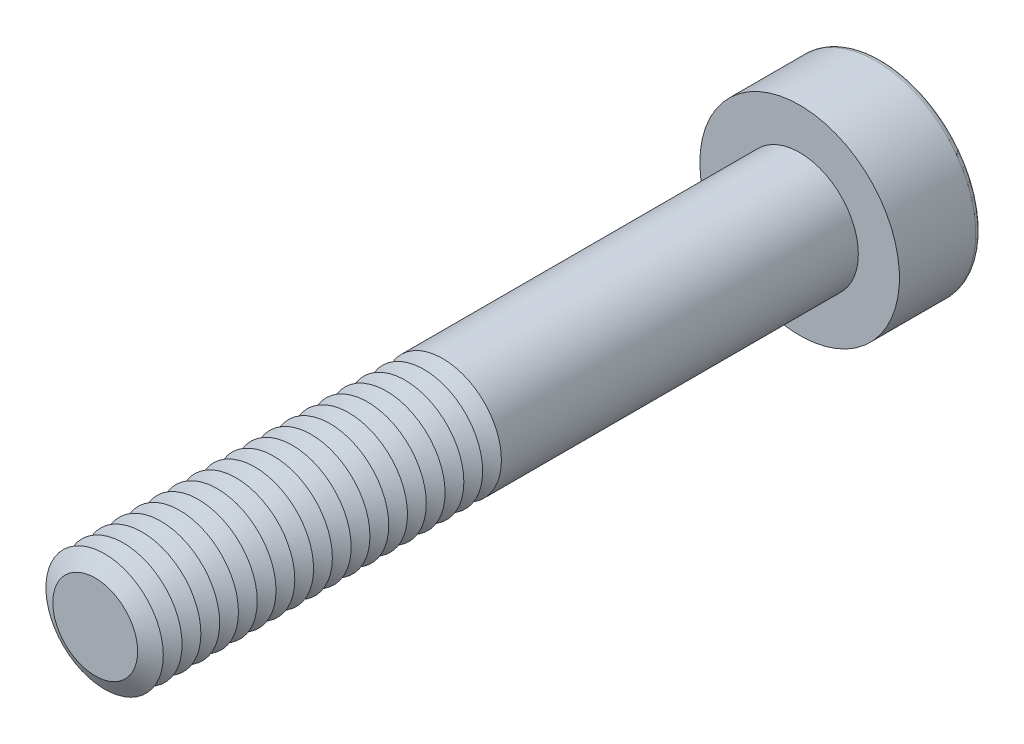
ISO-10303-21;
HEADER;
FILE_DESCRIPTION(('STEP AP214'),'2;1');
FILE_NAME('part.step','',(''),(''),'','','');
FILE_SCHEMA(('AUTOMOTIVE_DESIGN { 1 0 10303 214 1 1 1 1 }'));
ENDSEC;
DATA;
#1=APPLICATION_CONTEXT('core data for automotive mechanical design processes');
#2=APPLICATION_PROTOCOL_DEFINITION('international standard','automotive_design',2000,#1);
#3=PRODUCT_CONTEXT('',#1,'mechanical');
#4=PRODUCT('Part','Part','',(#3));
#5=PRODUCT_RELATED_PRODUCT_CATEGORY('part','',(#4));
#6=PRODUCT_DEFINITION_FORMATION('','',#4);
#7=PRODUCT_DEFINITION_CONTEXT('part definition',#1,'design');
#8=PRODUCT_DEFINITION('design','',#6,#7);
#9=PRODUCT_DEFINITION_SHAPE('','',#8);
#10=(LENGTH_UNIT() NAMED_UNIT(*) SI_UNIT(.MILLI.,.METRE.));
#11=(NAMED_UNIT(*) PLANE_ANGLE_UNIT() SI_UNIT($,.RADIAN.));
#12=(NAMED_UNIT(*) SI_UNIT($,.STERADIAN.) SOLID_ANGLE_UNIT());
#13=UNCERTAINTY_MEASURE_WITH_UNIT(LENGTH_MEASURE(1.E-05),#10,'distance_accuracy_value','');
#14=(GEOMETRIC_REPRESENTATION_CONTEXT(3) GLOBAL_UNCERTAINTY_ASSIGNED_CONTEXT((#13)) GLOBAL_UNIT_ASSIGNED_CONTEXT((#10,
#11,#12)) REPRESENTATION_CONTEXT('',''));
#15=CARTESIAN_POINT('',(0.,0.,0.));
#16=DIRECTION('',(0.,0.,1.));
#17=DIRECTION('',(1.,0.,0.));
#18=AXIS2_PLACEMENT_3D('',#15,#16,#17);
#19=CARTESIAN_POINT('',(0.,0.,27.2));
#20=DIRECTION('',(0.,0.,1.));
#21=DIRECTION('',(1.,0.,0.));
#22=AXIS2_PLACEMENT_3D('',#19,#20,#21);
#23=CONICAL_SURFACE('',#22,2.5,1.0471975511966);
#24=CARTESIAN_POINT('',(0.,0.,26.8));
#25=DIRECTION('',(0.,0.,1.));
#26=DIRECTION('',(1.,0.,0.));
#27=AXIS2_PLACEMENT_3D('',#24,#25,#26);
#28=CIRCLE('',#27,1.80717967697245);
#29=CARTESIAN_POINT('',(1.80717967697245,0.,26.8));
#30=VERTEX_POINT('',#29);
#31=EDGE_CURVE('E314',#30,#30,#28,.T.);
#32=ORIENTED_EDGE('',*,*,#31,.T.);
#33=EDGE_LOOP('',(#32));
#34=FACE_BOUND('',#33,.T.);
#35=CARTESIAN_POINT('',(0.,0.,27.2));
#36=DIRECTION('',(0.,0.,1.));
#37=DIRECTION('',(1.,0.,0.));
#38=AXIS2_PLACEMENT_3D('',#35,#36,#37);
#39=CIRCLE('',#38,2.5);
#40=CARTESIAN_POINT('',(2.5,0.,27.2));
#41=VERTEX_POINT('',#40);
#42=EDGE_CURVE('E317',#41,#41,#39,.T.);
#43=ORIENTED_EDGE('',*,*,#42,.F.);
#44=EDGE_LOOP('',(#43));
#45=FACE_BOUND('',#44,.T.);
#46=ADVANCED_FACE('F39',(#34,#45),#23,.T.);
#47=CARTESIAN_POINT('',(0.,0.,26.8));
#48=DIRECTION('',(0.,0.,-1.));
#49=DIRECTION('',(-1.,0.,0.));
#50=AXIS2_PLACEMENT_3D('',#47,#48,#49);
#51=CONICAL_SURFACE('',#50,1.80717967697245,1.04719755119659);
#52=CARTESIAN_POINT('',(0.,0.,26.4));
#53=DIRECTION('',(0.,0.,1.));
#54=DIRECTION('',(1.,0.,0.));
#55=AXIS2_PLACEMENT_3D('',#52,#53,#54);
#56=CIRCLE('',#55,2.5);
#57=CARTESIAN_POINT('',(2.5,0.,26.4));
#58=VERTEX_POINT('',#57);
#59=EDGE_CURVE('E325',#58,#58,#56,.T.);
#60=ORIENTED_EDGE('',*,*,#59,.T.);
#61=EDGE_LOOP('',(#60));
#62=FACE_BOUND('',#61,.T.);
#63=ORIENTED_EDGE('',*,*,#31,.F.);
#64=EDGE_LOOP('',(#63));
#65=FACE_BOUND('',#64,.T.);
#66=ADVANCED_FACE('F245',(#62,#65),#51,.T.);
#67=CARTESIAN_POINT('',(0.,0.,30.));
#68=DIRECTION('',(0.,0.,1.));
#69=DIRECTION('',(1.,0.,0.));
#70=AXIS2_PLACEMENT_3D('',#67,#68,#69);
#71=PLANE('',#70);
#72=CARTESIAN_POINT('',(0.,0.,30.));
#73=DIRECTION('',(0.,0.,1.));
#74=DIRECTION('',(1.,0.,0.));
#75=AXIS2_PLACEMENT_3D('',#72,#73,#74);
#76=CIRCLE('',#75,1.80717967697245);
#77=CARTESIAN_POINT('',(1.80717967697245,0.,30.));
#78=VERTEX_POINT('',#77);
#79=EDGE_CURVE('E174',#78,#78,#76,.T.);
#80=ORIENTED_EDGE('',*,*,#79,.T.);
#81=EDGE_LOOP('',(#80));
#82=FACE_BOUND('',#81,.T.);
#83=ADVANCED_FACE('F251',(#82),#71,.T.);
#84=CARTESIAN_POINT('',(0.,0.,30.));
#85=DIRECTION('',(0.,0.,-1.));
#86=DIRECTION('',(-1.,0.,0.));
#87=AXIS2_PLACEMENT_3D('',#84,#85,#86);
#88=CONICAL_SURFACE('',#87,1.80717967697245,1.04719755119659);
#89=CARTESIAN_POINT('',(0.,0.,29.6));
#90=DIRECTION('',(0.,0.,1.));
#91=DIRECTION('',(1.,0.,0.));
#92=AXIS2_PLACEMENT_3D('',#89,#90,#91);
#93=CIRCLE('',#92,2.5);
#94=CARTESIAN_POINT('',(2.5,0.,29.6));
#95=VERTEX_POINT('',#94);
#96=EDGE_CURVE('E291',#95,#95,#93,.T.);
#97=ORIENTED_EDGE('',*,*,#96,.T.);
#98=EDGE_LOOP('',(#97));
#99=FACE_BOUND('',#98,.T.);
#100=ORIENTED_EDGE('',*,*,#79,.F.);
#101=EDGE_LOOP('',(#100));
#102=FACE_BOUND('',#101,.T.);
#103=ADVANCED_FACE('F199',(#99,#102),#88,.T.);
#104=CARTESIAN_POINT('',(0.,0.,29.6));
#105=DIRECTION('',(0.,0.,1.));
#106=DIRECTION('',(1.,0.,0.));
#107=AXIS2_PLACEMENT_3D('',#104,#105,#106);
#108=CONICAL_SURFACE('',#107,2.5,1.0471975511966);
#109=CARTESIAN_POINT('',(0.,0.,29.2));
#110=DIRECTION('',(0.,0.,1.));
#111=DIRECTION('',(1.,0.,0.));
#112=AXIS2_PLACEMENT_3D('',#109,#110,#111);
#113=CIRCLE('',#112,1.80717967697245);
#114=CARTESIAN_POINT('',(1.80717967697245,0.,29.2));
#115=VERTEX_POINT('',#114);
#116=EDGE_CURVE('E288',#115,#115,#113,.T.);
#117=ORIENTED_EDGE('',*,*,#116,.T.);
#118=EDGE_LOOP('',(#117));
#119=FACE_BOUND('',#118,.T.);
#120=ORIENTED_EDGE('',*,*,#96,.F.);
#121=EDGE_LOOP('',(#120));
#122=FACE_BOUND('',#121,.T.);
#123=ADVANCED_FACE('F277',(#119,#122),#108,.T.);
#124=CARTESIAN_POINT('',(0.,0.,29.2));
#125=DIRECTION('',(0.,0.,-1.));
#126=DIRECTION('',(-1.,0.,0.));
#127=AXIS2_PLACEMENT_3D('',#124,#125,#126);
#128=CONICAL_SURFACE('',#127,1.80717967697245,1.04719755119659);
#129=CARTESIAN_POINT('',(0.,0.,28.8));
#130=DIRECTION('',(0.,0.,1.));
#131=DIRECTION('',(1.,0.,0.));
#132=AXIS2_PLACEMENT_3D('',#129,#130,#131);
#133=CIRCLE('',#132,2.5);
#134=CARTESIAN_POINT('',(2.5,0.,28.8));
#135=VERTEX_POINT('',#134);
#136=EDGE_CURVE('E300',#135,#135,#133,.T.);
#137=ORIENTED_EDGE('',*,*,#136,.T.);
#138=EDGE_LOOP('',(#137));
#139=FACE_BOUND('',#138,.T.);
#140=ORIENTED_EDGE('',*,*,#116,.F.);
#141=EDGE_LOOP('',(#140));
#142=FACE_BOUND('',#141,.T.);
#143=ADVANCED_FACE('F274',(#139,#142),#128,.T.);
#144=CARTESIAN_POINT('',(0.,0.,28.8));
#145=DIRECTION('',(0.,0.,1.));
#146=DIRECTION('',(1.,0.,0.));
#147=AXIS2_PLACEMENT_3D('',#144,#145,#146);
#148=CONICAL_SURFACE('',#147,2.5,1.0471975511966);
#149=CARTESIAN_POINT('',(0.,0.,28.4));
#150=DIRECTION('',(0.,0.,1.));
#151=DIRECTION('',(1.,0.,0.));
#152=AXIS2_PLACEMENT_3D('',#149,#150,#151);
#153=CIRCLE('',#152,1.80717967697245);
#154=CARTESIAN_POINT('',(1.80717967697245,0.,28.4));
#155=VERTEX_POINT('',#154);
#156=EDGE_CURVE('E293',#155,#155,#153,.T.);
#157=ORIENTED_EDGE('',*,*,#156,.T.);
#158=EDGE_LOOP('',(#157));
#159=FACE_BOUND('',#158,.T.);
#160=ORIENTED_EDGE('',*,*,#136,.F.);
#161=EDGE_LOOP('',(#160));
#162=FACE_BOUND('',#161,.T.);
#163=ADVANCED_FACE('F270',(#159,#162),#148,.T.);
#164=CARTESIAN_POINT('',(0.,0.,28.4));
#165=DIRECTION('',(0.,0.,-1.));
#166=DIRECTION('',(-1.,0.,0.));
#167=AXIS2_PLACEMENT_3D('',#164,#165,#166);
#168=CONICAL_SURFACE('',#167,1.80717967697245,1.04719755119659);
#169=CARTESIAN_POINT('',(0.,0.,28.));
#170=DIRECTION('',(0.,0.,1.));
#171=DIRECTION('',(1.,0.,0.));
#172=AXIS2_PLACEMENT_3D('',#169,#170,#171);
#173=CIRCLE('',#172,2.5);
#174=CARTESIAN_POINT('',(2.5,0.,28.));
#175=VERTEX_POINT('',#174);
#176=EDGE_CURVE('E310',#175,#175,#173,.T.);
#177=ORIENTED_EDGE('',*,*,#176,.T.);
#178=EDGE_LOOP('',(#177));
#179=FACE_BOUND('',#178,.T.);
#180=ORIENTED_EDGE('',*,*,#156,.F.);
#181=EDGE_LOOP('',(#180));
#182=FACE_BOUND('',#181,.T.);
#183=ADVANCED_FACE('F266',(#179,#182),#168,.T.);
#184=CARTESIAN_POINT('',(0.,0.,28.));
#185=DIRECTION('',(0.,0.,1.));
#186=DIRECTION('',(1.,0.,0.));
#187=AXIS2_PLACEMENT_3D('',#184,#185,#186);
#188=CONICAL_SURFACE('',#187,2.5,1.0471975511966);
#189=CARTESIAN_POINT('',(0.,0.,27.6));
#190=DIRECTION('',(0.,0.,1.));
#191=DIRECTION('',(1.,0.,0.));
#192=AXIS2_PLACEMENT_3D('',#189,#190,#191);
#193=CIRCLE('',#192,1.80717967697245);
#194=CARTESIAN_POINT('',(1.80717967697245,0.,27.6));
#195=VERTEX_POINT('',#194);
#196=EDGE_CURVE('E306',#195,#195,#193,.T.);
#197=ORIENTED_EDGE('',*,*,#196,.T.);
#198=EDGE_LOOP('',(#197));
#199=FACE_BOUND('',#198,.T.);
#200=ORIENTED_EDGE('',*,*,#176,.F.);
#201=EDGE_LOOP('',(#200));
#202=FACE_BOUND('',#201,.T.);
#203=ADVANCED_FACE('F262',(#199,#202),#188,.T.);
#204=CARTESIAN_POINT('',(0.,0.,27.6));
#205=DIRECTION('',(0.,0.,-1.));
#206=DIRECTION('',(-1.,0.,0.));
#207=AXIS2_PLACEMENT_3D('',#204,#205,#206);
#208=CONICAL_SURFACE('',#207,1.80717967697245,1.04719755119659);
#209=ORIENTED_EDGE('',*,*,#42,.T.);
#210=EDGE_LOOP('',(#209));
#211=FACE_BOUND('',#210,.T.);
#212=ORIENTED_EDGE('',*,*,#196,.F.);
#213=EDGE_LOOP('',(#212));
#214=FACE_BOUND('',#213,.T.);
#215=ADVANCED_FACE('F258',(#211,#214),#208,.T.);
#216=CARTESIAN_POINT('',(0.,0.,26.4));
#217=DIRECTION('',(0.,0.,1.));
#218=DIRECTION('',(1.,0.,0.));
#219=AXIS2_PLACEMENT_3D('',#216,#217,#218);
#220=CONICAL_SURFACE('',#219,2.5,1.0471975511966);
#221=CARTESIAN_POINT('',(0.,0.,26.));
#222=DIRECTION('',(0.,0.,1.));
#223=DIRECTION('',(1.,0.,0.));
#224=AXIS2_PLACEMENT_3D('',#221,#222,#223);
#225=CIRCLE('',#224,1.80717967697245);
#226=CARTESIAN_POINT('',(1.80717967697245,0.,26.));
#227=VERTEX_POINT('',#226);
#228=EDGE_CURVE('E321',#227,#227,#225,.T.);
#229=ORIENTED_EDGE('',*,*,#228,.T.);
#230=EDGE_LOOP('',(#229));
#231=FACE_BOUND('',#230,.T.);
#232=ORIENTED_EDGE('',*,*,#59,.F.);
#233=EDGE_LOOP('',(#232));
#234=FACE_BOUND('',#233,.T.);
#235=ADVANCED_FACE('F261',(#231,#234),#220,.T.);
#236=CARTESIAN_POINT('',(0.,0.,26.));
#237=DIRECTION('',(0.,0.,-1.));
#238=DIRECTION('',(-1.,0.,0.));
#239=AXIS2_PLACEMENT_3D('',#236,#237,#238);
#240=CONICAL_SURFACE('',#239,1.80717967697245,1.04719755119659);
#241=CARTESIAN_POINT('',(0.,0.,25.6));
#242=DIRECTION('',(0.,0.,1.));
#243=DIRECTION('',(1.,0.,0.));
#244=AXIS2_PLACEMENT_3D('',#241,#242,#243);
#245=CIRCLE('',#244,2.5);
#246=CARTESIAN_POINT('',(2.5,0.,25.6));
#247=VERTEX_POINT('',#246);
#248=EDGE_CURVE('E333',#247,#247,#245,.T.);
#249=ORIENTED_EDGE('',*,*,#248,.T.);
#250=EDGE_LOOP('',(#249));
#251=FACE_BOUND('',#250,.T.);
#252=ORIENTED_EDGE('',*,*,#228,.F.);
#253=EDGE_LOOP('',(#252));
#254=FACE_BOUND('',#253,.T.);
#255=ADVANCED_FACE('F543',(#251,#254),#240,.T.);
#256=CARTESIAN_POINT('',(0.,0.,25.6));
#257=DIRECTION('',(0.,0.,1.));
#258=DIRECTION('',(1.,0.,0.));
#259=AXIS2_PLACEMENT_3D('',#256,#257,#258);
#260=CONICAL_SURFACE('',#259,2.5,1.0471975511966);
#261=CARTESIAN_POINT('',(0.,0.,25.2));
#262=DIRECTION('',(0.,0.,1.));
#263=DIRECTION('',(1.,0.,0.));
#264=AXIS2_PLACEMENT_3D('',#261,#262,#263);
#265=CIRCLE('',#264,1.80717967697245);
#266=CARTESIAN_POINT('',(1.80717967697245,0.,25.2));
#267=VERTEX_POINT('',#266);
#268=EDGE_CURVE('E329',#267,#267,#265,.T.);
#269=ORIENTED_EDGE('',*,*,#268,.T.);
#270=EDGE_LOOP('',(#269));
#271=FACE_BOUND('',#270,.T.);
#272=ORIENTED_EDGE('',*,*,#248,.F.);
#273=EDGE_LOOP('',(#272));
#274=FACE_BOUND('',#273,.T.);
#275=ADVANCED_FACE('F539',(#271,#274),#260,.T.);
#276=CARTESIAN_POINT('',(0.,0.,25.2));
#277=DIRECTION('',(0.,0.,-1.));
#278=DIRECTION('',(-1.,0.,0.));
#279=AXIS2_PLACEMENT_3D('',#276,#277,#278);
#280=CONICAL_SURFACE('',#279,1.80717967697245,1.04719755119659);
#281=CARTESIAN_POINT('',(0.,0.,24.8));
#282=DIRECTION('',(0.,0.,1.));
#283=DIRECTION('',(1.,0.,0.));
#284=AXIS2_PLACEMENT_3D('',#281,#282,#283);
#285=CIRCLE('',#284,2.5);
#286=CARTESIAN_POINT('',(2.5,0.,24.8));
#287=VERTEX_POINT('',#286);
#288=EDGE_CURVE('E341',#287,#287,#285,.T.);
#289=ORIENTED_EDGE('',*,*,#288,.T.);
#290=EDGE_LOOP('',(#289));
#291=FACE_BOUND('',#290,.T.);
#292=ORIENTED_EDGE('',*,*,#268,.F.);
#293=EDGE_LOOP('',(#292));
#294=FACE_BOUND('',#293,.T.);
#295=ADVANCED_FACE('F535',(#291,#294),#280,.T.);
#296=CARTESIAN_POINT('',(0.,0.,24.8));
#297=DIRECTION('',(0.,0.,1.));
#298=DIRECTION('',(1.,0.,0.));
#299=AXIS2_PLACEMENT_3D('',#296,#297,#298);
#300=CONICAL_SURFACE('',#299,2.5,1.0471975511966);
#301=CARTESIAN_POINT('',(0.,0.,24.4));
#302=DIRECTION('',(0.,0.,1.));
#303=DIRECTION('',(1.,0.,0.));
#304=AXIS2_PLACEMENT_3D('',#301,#302,#303);
#305=CIRCLE('',#304,1.80717967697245);
#306=CARTESIAN_POINT('',(1.80717967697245,0.,24.4));
#307=VERTEX_POINT('',#306);
#308=EDGE_CURVE('E337',#307,#307,#305,.T.);
#309=ORIENTED_EDGE('',*,*,#308,.T.);
#310=EDGE_LOOP('',(#309));
#311=FACE_BOUND('',#310,.T.);
#312=ORIENTED_EDGE('',*,*,#288,.F.);
#313=EDGE_LOOP('',(#312));
#314=FACE_BOUND('',#313,.T.);
#315=ADVANCED_FACE('F531',(#311,#314),#300,.T.);
#316=CARTESIAN_POINT('',(0.,0.,24.4));
#317=DIRECTION('',(0.,0.,-1.));
#318=DIRECTION('',(-1.,0.,0.));
#319=AXIS2_PLACEMENT_3D('',#316,#317,#318);
#320=CONICAL_SURFACE('',#319,1.80717967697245,1.04719755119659);
#321=CARTESIAN_POINT('',(0.,0.,24.));
#322=DIRECTION('',(0.,0.,1.));
#323=DIRECTION('',(1.,0.,0.));
#324=AXIS2_PLACEMENT_3D('',#321,#322,#323);
#325=CIRCLE('',#324,2.5);
#326=CARTESIAN_POINT('',(2.5,0.,24.));
#327=VERTEX_POINT('',#326);
#328=EDGE_CURVE('E348',#327,#327,#325,.T.);
#329=ORIENTED_EDGE('',*,*,#328,.T.);
#330=EDGE_LOOP('',(#329));
#331=FACE_BOUND('',#330,.T.);
#332=ORIENTED_EDGE('',*,*,#308,.F.);
#333=EDGE_LOOP('',(#332));
#334=FACE_BOUND('',#333,.T.);
#335=ADVANCED_FACE('F527',(#331,#334),#320,.T.);
#336=CARTESIAN_POINT('',(0.,0.,24.));
#337=DIRECTION('',(0.,0.,1.));
#338=DIRECTION('',(1.,0.,0.));
#339=AXIS2_PLACEMENT_3D('',#336,#337,#338);
#340=CONICAL_SURFACE('',#339,2.5,1.0471975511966);
#341=CARTESIAN_POINT('',(0.,0.,23.6));
#342=DIRECTION('',(0.,0.,1.));
#343=DIRECTION('',(1.,0.,0.));
#344=AXIS2_PLACEMENT_3D('',#341,#342,#343);
#345=CIRCLE('',#344,1.80717967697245);
#346=CARTESIAN_POINT('',(1.80717967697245,0.,23.6));
#347=VERTEX_POINT('',#346);
#348=EDGE_CURVE('E344',#347,#347,#345,.T.);
#349=ORIENTED_EDGE('',*,*,#348,.T.);
#350=EDGE_LOOP('',(#349));
#351=FACE_BOUND('',#350,.T.);
#352=ORIENTED_EDGE('',*,*,#328,.F.);
#353=EDGE_LOOP('',(#352));
#354=FACE_BOUND('',#353,.T.);
#355=ADVANCED_FACE('F523',(#351,#354),#340,.T.);
#356=CARTESIAN_POINT('',(0.,0.,23.6));
#357=DIRECTION('',(0.,0.,-1.));
#358=DIRECTION('',(-1.,0.,0.));
#359=AXIS2_PLACEMENT_3D('',#356,#357,#358);
#360=CONICAL_SURFACE('',#359,1.80717967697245,1.04719755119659);
#361=CARTESIAN_POINT('',(0.,0.,23.2));
#362=DIRECTION('',(0.,0.,1.));
#363=DIRECTION('',(1.,0.,0.));
#364=AXIS2_PLACEMENT_3D('',#361,#362,#363);
#365=CIRCLE('',#364,2.5);
#366=CARTESIAN_POINT('',(2.5,0.,23.2));
#367=VERTEX_POINT('',#366);
#368=EDGE_CURVE('E355',#367,#367,#365,.T.);
#369=ORIENTED_EDGE('',*,*,#368,.T.);
#370=EDGE_LOOP('',(#369));
#371=FACE_BOUND('',#370,.T.);
#372=ORIENTED_EDGE('',*,*,#348,.F.);
#373=EDGE_LOOP('',(#372));
#374=FACE_BOUND('',#373,.T.);
#375=ADVANCED_FACE('F519',(#371,#374),#360,.T.);
#376=CARTESIAN_POINT('',(0.,0.,23.2));
#377=DIRECTION('',(0.,0.,1.));
#378=DIRECTION('',(1.,0.,0.));
#379=AXIS2_PLACEMENT_3D('',#376,#377,#378);
#380=CONICAL_SURFACE('',#379,2.5,1.0471975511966);
#381=CARTESIAN_POINT('',(0.,0.,22.8));
#382=DIRECTION('',(0.,0.,1.));
#383=DIRECTION('',(1.,0.,0.));
#384=AXIS2_PLACEMENT_3D('',#381,#382,#383);
#385=CIRCLE('',#384,1.80717967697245);
#386=CARTESIAN_POINT('',(1.80717967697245,0.,22.8));
#387=VERTEX_POINT('',#386);
#388=EDGE_CURVE('E352',#387,#387,#385,.T.);
#389=ORIENTED_EDGE('',*,*,#388,.T.);
#390=EDGE_LOOP('',(#389));
#391=FACE_BOUND('',#390,.T.);
#392=ORIENTED_EDGE('',*,*,#368,.F.);
#393=EDGE_LOOP('',(#392));
#394=FACE_BOUND('',#393,.T.);
#395=ADVANCED_FACE('F515',(#391,#394),#380,.T.);
#396=CARTESIAN_POINT('',(0.,0.,22.8));
#397=DIRECTION('',(0.,0.,-1.));
#398=DIRECTION('',(-1.,0.,0.));
#399=AXIS2_PLACEMENT_3D('',#396,#397,#398);
#400=CONICAL_SURFACE('',#399,1.80717967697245,1.04719755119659);
#401=CARTESIAN_POINT('',(0.,0.,22.4));
#402=DIRECTION('',(0.,0.,1.));
#403=DIRECTION('',(1.,0.,0.));
#404=AXIS2_PLACEMENT_3D('',#401,#402,#403);
#405=CIRCLE('',#404,2.5);
#406=CARTESIAN_POINT('',(2.5,0.,22.4));
#407=VERTEX_POINT('',#406);
#408=EDGE_CURVE('E363',#407,#407,#405,.T.);
#409=ORIENTED_EDGE('',*,*,#408,.T.);
#410=EDGE_LOOP('',(#409));
#411=FACE_BOUND('',#410,.T.);
#412=ORIENTED_EDGE('',*,*,#388,.F.);
#413=EDGE_LOOP('',(#412));
#414=FACE_BOUND('',#413,.T.);
#415=ADVANCED_FACE('F511',(#411,#414),#400,.T.);
#416=CARTESIAN_POINT('',(0.,0.,22.4));
#417=DIRECTION('',(0.,0.,1.));
#418=DIRECTION('',(1.,0.,0.));
#419=AXIS2_PLACEMENT_3D('',#416,#417,#418);
#420=CONICAL_SURFACE('',#419,2.5,1.0471975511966);
#421=CARTESIAN_POINT('',(0.,0.,22.));
#422=DIRECTION('',(0.,0.,1.));
#423=DIRECTION('',(1.,0.,0.));
#424=AXIS2_PLACEMENT_3D('',#421,#422,#423);
#425=CIRCLE('',#424,1.80717967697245);
#426=CARTESIAN_POINT('',(1.80717967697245,0.,22.));
#427=VERTEX_POINT('',#426);
#428=EDGE_CURVE('E359',#427,#427,#425,.T.);
#429=ORIENTED_EDGE('',*,*,#428,.T.);
#430=EDGE_LOOP('',(#429));
#431=FACE_BOUND('',#430,.T.);
#432=ORIENTED_EDGE('',*,*,#408,.F.);
#433=EDGE_LOOP('',(#432));
#434=FACE_BOUND('',#433,.T.);
#435=ADVANCED_FACE('F507',(#431,#434),#420,.T.);
#436=CARTESIAN_POINT('',(0.,0.,22.));
#437=DIRECTION('',(0.,0.,-1.));
#438=DIRECTION('',(-1.,0.,0.));
#439=AXIS2_PLACEMENT_3D('',#436,#437,#438);
#440=CONICAL_SURFACE('',#439,1.80717967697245,1.04719755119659);
#441=CARTESIAN_POINT('',(0.,0.,21.6));
#442=DIRECTION('',(0.,0.,1.));
#443=DIRECTION('',(1.,0.,0.));
#444=AXIS2_PLACEMENT_3D('',#441,#442,#443);
#445=CIRCLE('',#444,2.5);
#446=CARTESIAN_POINT('',(2.5,0.,21.6));
#447=VERTEX_POINT('',#446);
#448=EDGE_CURVE('E371',#447,#447,#445,.T.);
#449=ORIENTED_EDGE('',*,*,#448,.T.);
#450=EDGE_LOOP('',(#449));
#451=FACE_BOUND('',#450,.T.);
#452=ORIENTED_EDGE('',*,*,#428,.F.);
#453=EDGE_LOOP('',(#452));
#454=FACE_BOUND('',#453,.T.);
#455=ADVANCED_FACE('F503',(#451,#454),#440,.T.);
#456=CARTESIAN_POINT('',(0.,0.,21.6));
#457=DIRECTION('',(0.,0.,1.));
#458=DIRECTION('',(1.,0.,0.));
#459=AXIS2_PLACEMENT_3D('',#456,#457,#458);
#460=CONICAL_SURFACE('',#459,2.5,1.0471975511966);
#461=CARTESIAN_POINT('',(0.,0.,21.2));
#462=DIRECTION('',(0.,0.,1.));
#463=DIRECTION('',(1.,0.,0.));
#464=AXIS2_PLACEMENT_3D('',#461,#462,#463);
#465=CIRCLE('',#464,1.80717967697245);
#466=CARTESIAN_POINT('',(1.80717967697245,0.,21.2));
#467=VERTEX_POINT('',#466);
#468=EDGE_CURVE('E367',#467,#467,#465,.T.);
#469=ORIENTED_EDGE('',*,*,#468,.T.);
#470=EDGE_LOOP('',(#469));
#471=FACE_BOUND('',#470,.T.);
#472=ORIENTED_EDGE('',*,*,#448,.F.);
#473=EDGE_LOOP('',(#472));
#474=FACE_BOUND('',#473,.T.);
#475=ADVANCED_FACE('F499',(#471,#474),#460,.T.);
#476=CARTESIAN_POINT('',(0.,0.,21.2));
#477=DIRECTION('',(0.,0.,-1.));
#478=DIRECTION('',(-1.,0.,0.));
#479=AXIS2_PLACEMENT_3D('',#476,#477,#478);
#480=CONICAL_SURFACE('',#479,1.80717967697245,1.04719755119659);
#481=CARTESIAN_POINT('',(0.,0.,20.8));
#482=DIRECTION('',(0.,0.,1.));
#483=DIRECTION('',(1.,0.,0.));
#484=AXIS2_PLACEMENT_3D('',#481,#482,#483);
#485=CIRCLE('',#484,2.5);
#486=CARTESIAN_POINT('',(2.5,0.,20.8));
#487=VERTEX_POINT('',#486);
#488=EDGE_CURVE('E379',#487,#487,#485,.T.);
#489=ORIENTED_EDGE('',*,*,#488,.T.);
#490=EDGE_LOOP('',(#489));
#491=FACE_BOUND('',#490,.T.);
#492=ORIENTED_EDGE('',*,*,#468,.F.);
#493=EDGE_LOOP('',(#492));
#494=FACE_BOUND('',#493,.T.);
#495=ADVANCED_FACE('F495',(#491,#494),#480,.T.);
#496=CARTESIAN_POINT('',(0.,0.,20.8));
#497=DIRECTION('',(0.,0.,1.));
#498=DIRECTION('',(1.,0.,0.));
#499=AXIS2_PLACEMENT_3D('',#496,#497,#498);
#500=CONICAL_SURFACE('',#499,2.5,1.0471975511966);
#501=CARTESIAN_POINT('',(0.,0.,20.4));
#502=DIRECTION('',(0.,0.,1.));
#503=DIRECTION('',(1.,0.,0.));
#504=AXIS2_PLACEMENT_3D('',#501,#502,#503);
#505=CIRCLE('',#504,1.80717967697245);
#506=CARTESIAN_POINT('',(1.80717967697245,0.,20.4));
#507=VERTEX_POINT('',#506);
#508=EDGE_CURVE('E375',#507,#507,#505,.T.);
#509=ORIENTED_EDGE('',*,*,#508,.T.);
#510=EDGE_LOOP('',(#509));
#511=FACE_BOUND('',#510,.T.);
#512=ORIENTED_EDGE('',*,*,#488,.F.);
#513=EDGE_LOOP('',(#512));
#514=FACE_BOUND('',#513,.T.);
#515=ADVANCED_FACE('F491',(#511,#514),#500,.T.);
#516=CARTESIAN_POINT('',(0.,0.,20.4));
#517=DIRECTION('',(0.,0.,-1.));
#518=DIRECTION('',(-1.,0.,0.));
#519=AXIS2_PLACEMENT_3D('',#516,#517,#518);
#520=CONICAL_SURFACE('',#519,1.80717967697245,1.04719755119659);
#521=CARTESIAN_POINT('',(0.,0.,20.));
#522=DIRECTION('',(0.,0.,1.));
#523=DIRECTION('',(1.,0.,0.));
#524=AXIS2_PLACEMENT_3D('',#521,#522,#523);
#525=CIRCLE('',#524,2.5);
#526=CARTESIAN_POINT('',(2.5,0.,20.));
#527=VERTEX_POINT('',#526);
#528=EDGE_CURVE('E387',#527,#527,#525,.T.);
#529=ORIENTED_EDGE('',*,*,#528,.T.);
#530=EDGE_LOOP('',(#529));
#531=FACE_BOUND('',#530,.T.);
#532=ORIENTED_EDGE('',*,*,#508,.F.);
#533=EDGE_LOOP('',(#532));
#534=FACE_BOUND('',#533,.T.);
#535=ADVANCED_FACE('F487',(#531,#534),#520,.T.);
#536=CARTESIAN_POINT('',(0.,0.,20.));
#537=DIRECTION('',(0.,0.,1.));
#538=DIRECTION('',(1.,0.,0.));
#539=AXIS2_PLACEMENT_3D('',#536,#537,#538);
#540=CONICAL_SURFACE('',#539,2.5,1.0471975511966);
#541=CARTESIAN_POINT('',(0.,0.,19.6));
#542=DIRECTION('',(0.,0.,1.));
#543=DIRECTION('',(1.,0.,0.));
#544=AXIS2_PLACEMENT_3D('',#541,#542,#543);
#545=CIRCLE('',#544,1.80717967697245);
#546=CARTESIAN_POINT('',(1.80717967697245,0.,19.6));
#547=VERTEX_POINT('',#546);
#548=EDGE_CURVE('E383',#547,#547,#545,.T.);
#549=ORIENTED_EDGE('',*,*,#548,.T.);
#550=EDGE_LOOP('',(#549));
#551=FACE_BOUND('',#550,.T.);
#552=ORIENTED_EDGE('',*,*,#528,.F.);
#553=EDGE_LOOP('',(#552));
#554=FACE_BOUND('',#553,.T.);
#555=ADVANCED_FACE('F483',(#551,#554),#540,.T.);
#556=CARTESIAN_POINT('',(0.,0.,19.6));
#557=DIRECTION('',(0.,0.,-1.));
#558=DIRECTION('',(-1.,0.,0.));
#559=AXIS2_PLACEMENT_3D('',#556,#557,#558);
#560=CONICAL_SURFACE('',#559,1.80717967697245,1.04719755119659);
#561=CARTESIAN_POINT('',(0.,0.,19.2));
#562=DIRECTION('',(0.,0.,1.));
#563=DIRECTION('',(1.,0.,0.));
#564=AXIS2_PLACEMENT_3D('',#561,#562,#563);
#565=CIRCLE('',#564,2.5);
#566=CARTESIAN_POINT('',(2.5,0.,19.2));
#567=VERTEX_POINT('',#566);
#568=EDGE_CURVE('E395',#567,#567,#565,.T.);
#569=ORIENTED_EDGE('',*,*,#568,.T.);
#570=EDGE_LOOP('',(#569));
#571=FACE_BOUND('',#570,.T.);
#572=ORIENTED_EDGE('',*,*,#548,.F.);
#573=EDGE_LOOP('',(#572));
#574=FACE_BOUND('',#573,.T.);
#575=ADVANCED_FACE('F479',(#571,#574),#560,.T.);
#576=CARTESIAN_POINT('',(0.,0.,19.2));
#577=DIRECTION('',(0.,0.,1.));
#578=DIRECTION('',(1.,0.,0.));
#579=AXIS2_PLACEMENT_3D('',#576,#577,#578);
#580=CONICAL_SURFACE('',#579,2.5,1.0471975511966);
#581=CARTESIAN_POINT('',(0.,0.,18.8));
#582=DIRECTION('',(0.,0.,1.));
#583=DIRECTION('',(1.,0.,0.));
#584=AXIS2_PLACEMENT_3D('',#581,#582,#583);
#585=CIRCLE('',#584,1.80717967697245);
#586=CARTESIAN_POINT('',(1.80717967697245,0.,18.8));
#587=VERTEX_POINT('',#586);
#588=EDGE_CURVE('E391',#587,#587,#585,.T.);
#589=ORIENTED_EDGE('',*,*,#588,.T.);
#590=EDGE_LOOP('',(#589));
#591=FACE_BOUND('',#590,.T.);
#592=ORIENTED_EDGE('',*,*,#568,.F.);
#593=EDGE_LOOP('',(#592));
#594=FACE_BOUND('',#593,.T.);
#595=ADVANCED_FACE('F475',(#591,#594),#580,.T.);
#596=CARTESIAN_POINT('',(0.,0.,18.8));
#597=DIRECTION('',(0.,0.,-1.));
#598=DIRECTION('',(-1.,0.,0.));
#599=AXIS2_PLACEMENT_3D('',#596,#597,#598);
#600=CONICAL_SURFACE('',#599,1.80717967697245,1.04719755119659);
#601=CARTESIAN_POINT('',(0.,0.,18.4));
#602=DIRECTION('',(0.,0.,1.));
#603=DIRECTION('',(1.,0.,0.));
#604=AXIS2_PLACEMENT_3D('',#601,#602,#603);
#605=CIRCLE('',#604,2.5);
#606=CARTESIAN_POINT('',(2.5,0.,18.4));
#607=VERTEX_POINT('',#606);
#608=EDGE_CURVE('E403',#607,#607,#605,.T.);
#609=ORIENTED_EDGE('',*,*,#608,.T.);
#610=EDGE_LOOP('',(#609));
#611=FACE_BOUND('',#610,.T.);
#612=ORIENTED_EDGE('',*,*,#588,.F.);
#613=EDGE_LOOP('',(#612));
#614=FACE_BOUND('',#613,.T.);
#615=ADVANCED_FACE('F471',(#611,#614),#600,.T.);
#616=CARTESIAN_POINT('',(0.,0.,18.4));
#617=DIRECTION('',(0.,0.,1.));
#618=DIRECTION('',(1.,0.,0.));
#619=AXIS2_PLACEMENT_3D('',#616,#617,#618);
#620=CONICAL_SURFACE('',#619,2.5,1.0471975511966);
#621=CARTESIAN_POINT('',(0.,0.,18.));
#622=DIRECTION('',(0.,0.,1.));
#623=DIRECTION('',(1.,0.,0.));
#624=AXIS2_PLACEMENT_3D('',#621,#622,#623);
#625=CIRCLE('',#624,1.80717967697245);
#626=CARTESIAN_POINT('',(1.80717967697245,0.,18.));
#627=VERTEX_POINT('',#626);
#628=EDGE_CURVE('E399',#627,#627,#625,.T.);
#629=ORIENTED_EDGE('',*,*,#628,.T.);
#630=EDGE_LOOP('',(#629));
#631=FACE_BOUND('',#630,.T.);
#632=ORIENTED_EDGE('',*,*,#608,.F.);
#633=EDGE_LOOP('',(#632));
#634=FACE_BOUND('',#633,.T.);
#635=ADVANCED_FACE('F467',(#631,#634),#620,.T.);
#636=CARTESIAN_POINT('',(0.,0.,18.));
#637=DIRECTION('',(0.,0.,-1.));
#638=DIRECTION('',(-1.,0.,0.));
#639=AXIS2_PLACEMENT_3D('',#636,#637,#638);
#640=CONICAL_SURFACE('',#639,1.80717967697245,1.04719755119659);
#641=CARTESIAN_POINT('',(0.,0.,17.6));
#642=DIRECTION('',(0.,0.,1.));
#643=DIRECTION('',(1.,0.,0.));
#644=AXIS2_PLACEMENT_3D('',#641,#642,#643);
#645=CIRCLE('',#644,2.5);
#646=CARTESIAN_POINT('',(2.5,0.,17.6));
#647=VERTEX_POINT('',#646);
#648=EDGE_CURVE('E411',#647,#647,#645,.T.);
#649=ORIENTED_EDGE('',*,*,#648,.T.);
#650=EDGE_LOOP('',(#649));
#651=FACE_BOUND('',#650,.T.);
#652=ORIENTED_EDGE('',*,*,#628,.F.);
#653=EDGE_LOOP('',(#652));
#654=FACE_BOUND('',#653,.T.);
#655=ADVANCED_FACE('F463',(#651,#654),#640,.T.);
#656=CARTESIAN_POINT('',(0.,0.,17.6));
#657=DIRECTION('',(0.,0.,1.));
#658=DIRECTION('',(1.,0.,0.));
#659=AXIS2_PLACEMENT_3D('',#656,#657,#658);
#660=CONICAL_SURFACE('',#659,2.5,1.0471975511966);
#661=CARTESIAN_POINT('',(0.,0.,17.2));
#662=DIRECTION('',(0.,0.,1.));
#663=DIRECTION('',(1.,0.,0.));
#664=AXIS2_PLACEMENT_3D('',#661,#662,#663);
#665=CIRCLE('',#664,1.80717967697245);
#666=CARTESIAN_POINT('',(1.80717967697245,0.,17.2));
#667=VERTEX_POINT('',#666);
#668=EDGE_CURVE('E407',#667,#667,#665,.T.);
#669=ORIENTED_EDGE('',*,*,#668,.T.);
#670=EDGE_LOOP('',(#669));
#671=FACE_BOUND('',#670,.T.);
#672=ORIENTED_EDGE('',*,*,#648,.F.);
#673=EDGE_LOOP('',(#672));
#674=FACE_BOUND('',#673,.T.);
#675=ADVANCED_FACE('F459',(#671,#674),#660,.T.);
#676=CARTESIAN_POINT('',(0.,0.,17.2));
#677=DIRECTION('',(0.,0.,-1.));
#678=DIRECTION('',(-1.,0.,0.));
#679=AXIS2_PLACEMENT_3D('',#676,#677,#678);
#680=CONICAL_SURFACE('',#679,1.80717967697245,1.04719755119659);
#681=CARTESIAN_POINT('',(0.,0.,16.8));
#682=DIRECTION('',(0.,0.,1.));
#683=DIRECTION('',(1.,0.,0.));
#684=AXIS2_PLACEMENT_3D('',#681,#682,#683);
#685=CIRCLE('',#684,2.5);
#686=CARTESIAN_POINT('',(2.5,0.,16.8));
#687=VERTEX_POINT('',#686);
#688=EDGE_CURVE('E419',#687,#687,#685,.T.);
#689=ORIENTED_EDGE('',*,*,#688,.T.);
#690=EDGE_LOOP('',(#689));
#691=FACE_BOUND('',#690,.T.);
#692=ORIENTED_EDGE('',*,*,#668,.F.);
#693=EDGE_LOOP('',(#692));
#694=FACE_BOUND('',#693,.T.);
#695=ADVANCED_FACE('F455',(#691,#694),#680,.T.);
#696=CARTESIAN_POINT('',(0.,0.,16.8));
#697=DIRECTION('',(0.,0.,1.));
#698=DIRECTION('',(1.,0.,0.));
#699=AXIS2_PLACEMENT_3D('',#696,#697,#698);
#700=CONICAL_SURFACE('',#699,2.5,1.0471975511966);
#701=CARTESIAN_POINT('',(0.,0.,16.4));
#702=DIRECTION('',(0.,0.,1.));
#703=DIRECTION('',(1.,0.,0.));
#704=AXIS2_PLACEMENT_3D('',#701,#702,#703);
#705=CIRCLE('',#704,1.80717967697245);
#706=CARTESIAN_POINT('',(1.80717967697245,0.,16.4));
#707=VERTEX_POINT('',#706);
#708=EDGE_CURVE('E415',#707,#707,#705,.T.);
#709=ORIENTED_EDGE('',*,*,#708,.T.);
#710=EDGE_LOOP('',(#709));
#711=FACE_BOUND('',#710,.T.);
#712=ORIENTED_EDGE('',*,*,#688,.F.);
#713=EDGE_LOOP('',(#712));
#714=FACE_BOUND('',#713,.T.);
#715=ADVANCED_FACE('F450',(#711,#714),#700,.T.);
#716=CARTESIAN_POINT('',(0.,0.,16.4));
#717=DIRECTION('',(0.,0.,-1.));
#718=DIRECTION('',(-1.,0.,0.));
#719=AXIS2_PLACEMENT_3D('',#716,#717,#718);
#720=CONICAL_SURFACE('',#719,1.80717967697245,1.04719755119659);
#721=CARTESIAN_POINT('',(0.,0.,16.));
#722=DIRECTION('',(0.,0.,1.));
#723=DIRECTION('',(1.,0.,0.));
#724=AXIS2_PLACEMENT_3D('',#721,#722,#723);
#725=CIRCLE('',#724,2.5);
#726=CARTESIAN_POINT('',(2.5,0.,16.));
#727=VERTEX_POINT('',#726);
#728=EDGE_CURVE('E431',#727,#727,#725,.T.);
#729=ORIENTED_EDGE('',*,*,#728,.T.);
#730=EDGE_LOOP('',(#729));
#731=FACE_BOUND('',#730,.T.);
#732=ORIENTED_EDGE('',*,*,#708,.F.);
#733=EDGE_LOOP('',(#732));
#734=FACE_BOUND('',#733,.T.);
#735=ADVANCED_FACE('F436',(#731,#734),#720,.T.);
#736=CARTESIAN_POINT('',(0.,0.,16.));
#737=DIRECTION('',(0.,0.,1.));
#738=DIRECTION('',(1.,0.,0.));
#739=AXIS2_PLACEMENT_3D('',#736,#737,#738);
#740=CONICAL_SURFACE('',#739,2.5,1.0471975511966);
#741=CARTESIAN_POINT('',(0.,0.,15.6));
#742=DIRECTION('',(0.,0.,1.));
#743=DIRECTION('',(1.,0.,0.));
#744=AXIS2_PLACEMENT_3D('',#741,#742,#743);
#745=CIRCLE('',#744,1.80717967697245);
#746=CARTESIAN_POINT('',(1.80717967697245,0.,15.6));
#747=VERTEX_POINT('',#746);
#748=EDGE_CURVE('E423',#747,#747,#745,.T.);
#749=ORIENTED_EDGE('',*,*,#748,.T.);
#750=EDGE_LOOP('',(#749));
#751=FACE_BOUND('',#750,.T.);
#752=ORIENTED_EDGE('',*,*,#728,.F.);
#753=EDGE_LOOP('',(#752));
#754=FACE_BOUND('',#753,.T.);
#755=ADVANCED_FACE('F439',(#751,#754),#740,.T.);
#756=CARTESIAN_POINT('',(0.,0.,15.6));
#757=DIRECTION('',(0.,0.,-1.));
#758=DIRECTION('',(-1.,0.,0.));
#759=AXIS2_PLACEMENT_3D('',#756,#757,#758);
#760=CONICAL_SURFACE('',#759,1.80717967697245,1.04719755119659);
#761=CARTESIAN_POINT('',(0.,0.,15.2));
#762=DIRECTION('',(0.,0.,1.));
#763=DIRECTION('',(1.,0.,0.));
#764=AXIS2_PLACEMENT_3D('',#761,#762,#763);
#765=CIRCLE('',#764,2.5);
#766=CARTESIAN_POINT('',(2.5,0.,15.2));
#767=VERTEX_POINT('',#766);
#768=EDGE_CURVE('E427',#767,#767,#765,.T.);
#769=ORIENTED_EDGE('',*,*,#768,.T.);
#770=EDGE_LOOP('',(#769));
#771=FACE_BOUND('',#770,.T.);
#772=ORIENTED_EDGE('',*,*,#748,.F.);
#773=EDGE_LOOP('',(#772));
#774=FACE_BOUND('',#773,.T.);
#775=ADVANCED_FACE('F441',(#771,#774),#760,.T.);
#776=CARTESIAN_POINT('',(0.,0.,-1.25));
#777=DIRECTION('',(0.,0.,-1.));
#778=DIRECTION('',(-1.,0.,0.));
#779=AXIS2_PLACEMENT_3D('',#776,#777,#778);
#780=CONICAL_SURFACE('',#779,1.5,1.0471975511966);
#781=CARTESIAN_POINT('',(0.,0.,-0.383974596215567));
#782=VERTEX_POINT('',#781);
#783=VERTEX_LOOP('',#782);
#784=FACE_BOUND('',#783,.T.);
#785=CARTESIAN_POINT('',(0.,0.,-1.25));
#786=DIRECTION('',(0.,0.,-1.));
#787=DIRECTION('',(-1.,0.,0.));
#788=AXIS2_PLACEMENT_3D('',#785,#786,#787);
#789=CIRCLE('',#788,1.5);
#790=CARTESIAN_POINT('',(-1.29903810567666,0.749999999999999,-1.25));
#791=VERTEX_POINT('',#790);
#792=CARTESIAN_POINT('',(0.,1.5,-1.25));
#793=VERTEX_POINT('',#792);
#794=EDGE_CURVE('E149',#791,#793,#789,.T.);
#795=ORIENTED_EDGE('',*,*,#794,.T.);
#796=CARTESIAN_POINT('',(0.,0.,-1.25));
#797=DIRECTION('',(0.,0.,-1.));
#798=DIRECTION('',(-1.,0.,0.));
#799=AXIS2_PLACEMENT_3D('',#796,#797,#798);
#800=CIRCLE('',#799,1.5);
#801=CARTESIAN_POINT('',(1.29903810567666,0.75,-1.25));
#802=VERTEX_POINT('',#801);
#803=EDGE_CURVE('E54',#793,#802,#800,.T.);
#804=ORIENTED_EDGE('',*,*,#803,.T.);
#805=CARTESIAN_POINT('',(1.29903810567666,-0.75,-1.25));
#806=VERTEX_POINT('',#805);
#807=EDGE_CURVE('E1085',#802,#806,#800,.T.);
#808=ORIENTED_EDGE('',*,*,#807,.T.);
#809=CARTESIAN_POINT('',(0.,-1.5,-1.25));
#810=VERTEX_POINT('',#809);
#811=EDGE_CURVE('E1083',#806,#810,#800,.T.);
#812=ORIENTED_EDGE('',*,*,#811,.T.);
#813=CARTESIAN_POINT('',(-1.29903810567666,-0.749999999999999,-1.25));
#814=VERTEX_POINT('',#813);
#815=EDGE_CURVE('E1078',#810,#814,#800,.T.);
#816=ORIENTED_EDGE('',*,*,#815,.T.);
#817=EDGE_CURVE('E1076',#814,#791,#800,.T.);
#818=ORIENTED_EDGE('',*,*,#817,.T.);
#819=EDGE_LOOP('',(#795,#804,#808,#812,#816,#818));
#820=FACE_BOUND('',#819,.T.);
#821=ADVANCED_FACE('F201',(#784,#820),#780,.F.);
#822=CARTESIAN_POINT('',(0.,0.,-1.25));
#823=DIRECTION('',(0.,0.,-1.));
#824=DIRECTION('',(-1.,0.,0.));
#825=AXIS2_PLACEMENT_3D('',#822,#823,#824);
#826=PLANE('',#825);
#827=ORIENTED_EDGE('',*,*,#803,.F.);
#828=DIRECTION('',(1.,0.,0.));
#829=VECTOR('',#828,1.);
#830=CARTESIAN_POINT('',(-0.866025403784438,1.5,-1.25));
#831=LINE('',#830,#829);
#832=CARTESIAN_POINT('',(0.86602540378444,1.5,-1.25));
#833=VERTEX_POINT('',#832);
#834=EDGE_CURVE('E1130',#793,#833,#831,.T.);
#835=ORIENTED_EDGE('',*,*,#834,.T.);
#836=DIRECTION('',(0.5,-0.866025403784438,0.));
#837=VECTOR('',#836,1.);
#838=CARTESIAN_POINT('',(0.86602540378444,1.5,-1.25));
#839=LINE('',#838,#837);
#840=EDGE_CURVE('E155',#833,#802,#839,.T.);
#841=ORIENTED_EDGE('',*,*,#840,.T.);
#842=EDGE_LOOP('',(#827,#835,#841));
#843=FACE_BOUND('',#842,.T.);
#844=ADVANCED_FACE('F650',(#843),#826,.T.);
#845=ORIENTED_EDGE('',*,*,#807,.F.);
#846=CARTESIAN_POINT('',(1.73205080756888,0.,-1.25));
#847=VERTEX_POINT('',#846);
#848=EDGE_CURVE('E1126',#802,#847,#839,.T.);
#849=ORIENTED_EDGE('',*,*,#848,.T.);
#850=DIRECTION('',(-0.5,-0.866025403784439,0.));
#851=VECTOR('',#850,1.);
#852=CARTESIAN_POINT('',(1.73205080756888,0.,-1.25));
#853=LINE('',#852,#851);
#854=EDGE_CURVE('E1098',#847,#806,#853,.T.);
#855=ORIENTED_EDGE('',*,*,#854,.T.);
#856=EDGE_LOOP('',(#845,#849,#855));
#857=FACE_BOUND('',#856,.T.);
#858=ADVANCED_FACE('F660',(#857),#826,.T.);
#859=ORIENTED_EDGE('',*,*,#811,.F.);
#860=CARTESIAN_POINT('',(0.86602540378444,-1.5,-1.25));
#861=VERTEX_POINT('',#860);
#862=EDGE_CURVE('E1100',#806,#861,#853,.T.);
#863=ORIENTED_EDGE('',*,*,#862,.T.);
#864=DIRECTION('',(-1.,0.,0.));
#865=VECTOR('',#864,1.);
#866=CARTESIAN_POINT('',(0.86602540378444,-1.5,-1.25));
#867=LINE('',#866,#865);
#868=EDGE_CURVE('E1051',#861,#810,#867,.T.);
#869=ORIENTED_EDGE('',*,*,#868,.T.);
#870=EDGE_LOOP('',(#859,#863,#869));
#871=FACE_BOUND('',#870,.T.);
#872=ADVANCED_FACE('F670',(#871),#826,.T.);
#873=ORIENTED_EDGE('',*,*,#815,.F.);
#874=CARTESIAN_POINT('',(-0.866025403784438,-1.5,-1.25));
#875=VERTEX_POINT('',#874);
#876=EDGE_CURVE('E1095',#810,#875,#867,.T.);
#877=ORIENTED_EDGE('',*,*,#876,.T.);
#878=DIRECTION('',(-0.5,0.866025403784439,0.));
#879=VECTOR('',#878,1.);
#880=CARTESIAN_POINT('',(-0.866025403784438,-1.5,-1.25));
#881=LINE('',#880,#879);
#882=EDGE_CURVE('E1097',#875,#814,#881,.T.);
#883=ORIENTED_EDGE('',*,*,#882,.T.);
#884=EDGE_LOOP('',(#873,#877,#883));
#885=FACE_BOUND('',#884,.T.);
#886=ADVANCED_FACE('F678',(#885),#826,.T.);
#887=ORIENTED_EDGE('',*,*,#817,.F.);
#888=CARTESIAN_POINT('',(-1.73205080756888,0.,-1.25));
#889=VERTEX_POINT('',#888);
#890=EDGE_CURVE('E1102',#814,#889,#881,.T.);
#891=ORIENTED_EDGE('',*,*,#890,.T.);
#892=DIRECTION('',(0.5,0.866025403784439,0.));
#893=VECTOR('',#892,1.);
#894=CARTESIAN_POINT('',(-1.73205080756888,0.,-1.25));
#895=LINE('',#894,#893);
#896=EDGE_CURVE('E158',#889,#791,#895,.T.);
#897=ORIENTED_EDGE('',*,*,#896,.T.);
#898=EDGE_LOOP('',(#887,#891,#897));
#899=FACE_BOUND('',#898,.T.);
#900=ADVANCED_FACE('F231',(#899),#826,.T.);
#901=ORIENTED_EDGE('',*,*,#794,.F.);
#902=CARTESIAN_POINT('',(-0.866025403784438,1.5,-1.25));
#903=VERTEX_POINT('',#902);
#904=EDGE_CURVE('E1109',#791,#903,#895,.T.);
#905=ORIENTED_EDGE('',*,*,#904,.T.);
#906=EDGE_CURVE('E1127',#903,#793,#831,.T.);
#907=ORIENTED_EDGE('',*,*,#906,.T.);
#908=EDGE_LOOP('',(#901,#905,#907));
#909=FACE_BOUND('',#908,.T.);
#910=ADVANCED_FACE('F662',(#909),#826,.T.);
#911=CARTESIAN_POINT('',(-0.866025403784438,1.5,-1.25));
#912=DIRECTION('',(0.,1.,0.));
#913=DIRECTION('',(-1.,0.,0.));
#914=AXIS2_PLACEMENT_3D('',#911,#912,#913);
#915=PLANE('',#914);
#916=DIRECTION('',(0.,0.,-1.));
#917=VECTOR('',#916,1.);
#918=CARTESIAN_POINT('',(-0.866025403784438,1.5,-1.25));
#919=LINE('',#918,#917);
#920=CARTESIAN_POINT('',(-0.866025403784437,1.5,-3.5));
#921=VERTEX_POINT('',#920);
#922=EDGE_CURVE('E147',#903,#921,#919,.T.);
#923=ORIENTED_EDGE('',*,*,#922,.T.);
#924=CARTESIAN_POINT('',(-2.26080568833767,1.5,-3.76288767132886));
#925=CARTESIAN_POINT('',(-2.19307335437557,1.5,-3.74776718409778));
#926=CARTESIAN_POINT('',(-2.12529797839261,1.5,-3.73283936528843));
#927=CARTESIAN_POINT('',(-1.989639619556,1.5,-3.7034664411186));
#928=CARTESIAN_POINT('',(-1.92175663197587,1.5,-3.6890213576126));
#929=CARTESIAN_POINT('',(-1.71778516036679,1.5,-3.6465295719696));
#930=CARTESIAN_POINT('',(-1.58151166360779,1.5,-3.61935744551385));
#931=CARTESIAN_POINT('',(-1.30947840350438,1.5,-3.56878855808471));
#932=CARTESIAN_POINT('',(-1.17372447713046,1.5,-3.54536102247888));
#933=CARTESIAN_POINT('',(-0.90140428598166,1.5,-3.50385032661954));
#934=CARTESIAN_POINT('',(-0.764838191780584,1.5,-3.48576608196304));
#935=CARTESIAN_POINT('',(-0.489293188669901,1.5,-3.45729203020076));
#936=CARTESIAN_POINT('',(-0.350304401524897,1.5,-3.44699084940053));
#937=CARTESIAN_POINT('',(-0.14157144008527,1.5,-3.43918165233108));
#938=CARTESIAN_POINT('',(-0.0719628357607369,1.5,-3.43785196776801));
#939=CARTESIAN_POINT('',(0.0672555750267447,1.5,-3.43779336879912));
#940=CARTESIAN_POINT('',(0.136865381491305,1.5,-3.43906445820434));
#941=CARTESIAN_POINT('',(0.346114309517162,1.5,-3.44672257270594));
#942=CARTESIAN_POINT('',(0.48561964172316,1.5,-3.45697478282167));
#943=CARTESIAN_POINT('',(0.76382969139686,1.5,-3.48560011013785));
#944=CARTESIAN_POINT('',(0.902533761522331,1.5,-3.50397905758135));
#945=CARTESIAN_POINT('',(1.18270277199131,1.5,-3.54677522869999));
#946=CARTESIAN_POINT('',(1.32414472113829,1.5,-3.57133816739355));
#947=CARTESIAN_POINT('',(1.60634089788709,1.5,-3.62417713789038));
#948=CARTESIAN_POINT('',(1.74709501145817,1.5,-3.65245376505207));
#949=CARTESIAN_POINT('',(2.02813527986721,1.5,-3.71141289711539));
#950=CARTESIAN_POINT('',(2.16842128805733,1.5,-3.74209609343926));
#951=CARTESIAN_POINT('',(2.44863558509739,1.5,-3.80505759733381));
#952=CARTESIAN_POINT('',(2.5885638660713,1.5,-3.8373359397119));
#953=CARTESIAN_POINT('',(2.86645602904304,1.5,-3.90258693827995));
#954=CARTESIAN_POINT('',(3.0044230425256,1.5,-3.93554631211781));
#955=CARTESIAN_POINT('',(3.28017563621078,1.5,-4.00222717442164));
#956=CARTESIAN_POINT('',(3.41796121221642,1.5,-4.03594868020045));
#957=CARTESIAN_POINT('',(3.69320305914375,1.5,-4.10389962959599));
#958=CARTESIAN_POINT('',(3.83065952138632,1.5,-4.13812829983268));
#959=CARTESIAN_POINT('',(4.10546119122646,1.5,-4.20700872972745));
#960=CARTESIAN_POINT('',(4.24280640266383,1.5,-4.2416604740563));
#961=CARTESIAN_POINT('',(4.38011382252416,1.5,-4.27645965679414));
#962=B_SPLINE_CURVE_WITH_KNOTS('',3,(#924,#925,#926,#927,#928,#929,#930,#931,#932,#933,#934,
#935,#936,#937,#938,#939,#940,#941,#942,#943,#944,#945,#946,#947,#948,#949,#950,#951,#952,#953,
#954,#955,#956,#957,#958,#959,#960,#961),.UNSPECIFIED.,.F.,.F.,(4,2,2,2,2,2,2,2,2,2,2,2,2,2,2,2,
2,2,4),(0.,0.208198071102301,0.416405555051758,0.833243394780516,1.2464565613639,
1.65958581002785,2.07735129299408,2.28617008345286,2.49498917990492,2.91428402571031,
3.33388016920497,3.76448033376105,4.19514961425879,4.62594308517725,5.05674596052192,
5.48229088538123,5.90784548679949,6.33280701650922,6.75775319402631),.UNSPECIFIED.);
#963=CARTESIAN_POINT('',(0.866025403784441,1.5,-3.5));
#964=VERTEX_POINT('',#963);
#965=EDGE_CURVE('E124',#921,#964,#962,.T.);
#966=ORIENTED_EDGE('',*,*,#965,.T.);
#967=DIRECTION('',(0.,0.,-1.));
#968=VECTOR('',#967,1.);
#969=CARTESIAN_POINT('',(0.86602540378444,1.5,-1.25));
#970=LINE('',#969,#968);
#971=EDGE_CURVE('E143',#833,#964,#970,.T.);
#972=ORIENTED_EDGE('',*,*,#971,.F.);
#973=ORIENTED_EDGE('',*,*,#834,.F.);
#974=ORIENTED_EDGE('',*,*,#906,.F.);
#975=EDGE_LOOP('',(#923,#966,#972,#973,#974));
#976=FACE_BOUND('',#975,.T.);
#977=ADVANCED_FACE('F141',(#976),#915,.F.);
#978=CARTESIAN_POINT('',(0.86602540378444,1.5,-1.25));
#979=DIRECTION('',(0.866025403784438,0.5,0.));
#980=DIRECTION('',(-0.5,0.866025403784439,0.));
#981=AXIS2_PLACEMENT_3D('',#978,#979,#980);
#982=PLANE('',#981);
#983=ORIENTED_EDGE('',*,*,#971,.T.);
#984=CARTESIAN_POINT('',(0.865909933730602,1.5002,-3.50003094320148));
#985=CARTESIAN_POINT('',(0.901883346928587,1.43789222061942,-3.49038632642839));
#986=CARTESIAN_POINT('',(0.937921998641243,1.37547144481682,-3.48163049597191));
#987=CARTESIAN_POINT('',(1.01012661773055,1.25040937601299,-3.46624719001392));
#988=CARTESIAN_POINT('',(1.04629263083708,1.18776800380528,-3.4596205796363));
#989=CARTESIAN_POINT('',(1.11853262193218,1.06264466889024,-3.44888268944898));
#990=CARTESIAN_POINT('',(1.15460611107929,1.00016355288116,-3.44475860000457));
#991=CARTESIAN_POINT('',(1.22679910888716,0.875121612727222,-3.43922860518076));
#992=CARTESIAN_POINT('',(1.26291860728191,0.812560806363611,-3.43782217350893));
#993=CARTESIAN_POINT('',(1.33515760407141,0.68743919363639,-3.43782217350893));
#994=CARTESIAN_POINT('',(1.37127710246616,0.62487838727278,-3.43922860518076));
#995=CARTESIAN_POINT('',(1.44347010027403,0.49983644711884,-3.44475860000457));
#996=CARTESIAN_POINT('',(1.47954358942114,0.437355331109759,-3.44888268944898));
#997=CARTESIAN_POINT('',(1.55178358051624,0.312231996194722,-3.4596205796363));
#998=CARTESIAN_POINT('',(1.58794959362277,0.249590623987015,-3.46624719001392));
#999=CARTESIAN_POINT('',(1.66015421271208,0.124528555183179,-3.48163049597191));
#1000=CARTESIAN_POINT('',(1.69619286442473,0.0621077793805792,-3.49038632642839));
#1001=CARTESIAN_POINT('',(1.73216627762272,-0.000199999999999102,-3.50003094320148));
#1002=B_SPLINE_CURVE_WITH_KNOTS('',3,(#984,#985,#986,#987,#988,#989,#990,#991,#992,#993,#994,
#995,#996,#997,#998,#999,#1000,#1001),.UNSPECIFIED.,.F.,.F.,(4,2,2,2,2,2,2,2,4),(0.,
0.217782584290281,0.435653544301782,0.652399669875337,0.869103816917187,1.08580796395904,
1.30255408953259,1.52042504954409,1.73820763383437),.UNSPECIFIED.);
#1003=CARTESIAN_POINT('',(1.73205080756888,0.,-3.5));
#1004=VERTEX_POINT('',#1003);
#1005=EDGE_CURVE('E11',#964,#1004,#1002,.T.);
#1006=ORIENTED_EDGE('',*,*,#1005,.T.);
#1007=DIRECTION('',(0.,0.,-1.));
#1008=VECTOR('',#1007,1.);
#1009=CARTESIAN_POINT('',(1.73205080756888,0.,-1.25));
#1010=LINE('',#1009,#1008);
#1011=EDGE_CURVE('E157',#847,#1004,#1010,.T.);
#1012=ORIENTED_EDGE('',*,*,#1011,.F.);
#1013=ORIENTED_EDGE('',*,*,#848,.F.);
#1014=ORIENTED_EDGE('',*,*,#840,.F.);
#1015=EDGE_LOOP('',(#983,#1006,#1012,#1013,#1014));
#1016=FACE_BOUND('',#1015,.T.);
#1017=ADVANCED_FACE('F152',(#1016),#982,.F.);
#1018=CARTESIAN_POINT('',(1.73205080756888,0.,-1.25));
#1019=DIRECTION('',(0.866025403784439,-0.5,0.));
#1020=DIRECTION('',(0.5,0.866025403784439,0.));
#1021=AXIS2_PLACEMENT_3D('',#1018,#1019,#1020);
#1022=PLANE('',#1021);
#1023=ORIENTED_EDGE('',*,*,#1011,.T.);
#1024=CARTESIAN_POINT('',(1.73216627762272,0.000200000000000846,-3.50003094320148));
#1025=CARTESIAN_POINT('',(1.69619286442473,-0.0621077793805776,-3.49038632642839));
#1026=CARTESIAN_POINT('',(1.66015421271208,-0.124528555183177,-3.48163049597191));
#1027=CARTESIAN_POINT('',(1.58794959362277,-0.249590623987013,-3.46624719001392));
#1028=CARTESIAN_POINT('',(1.55178358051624,-0.312231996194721,-3.4596205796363));
#1029=CARTESIAN_POINT('',(1.47954358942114,-0.437355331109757,-3.44888268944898));
#1030=CARTESIAN_POINT('',(1.44347010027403,-0.499836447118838,-3.44475860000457));
#1031=CARTESIAN_POINT('',(1.37127710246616,-0.624878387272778,-3.43922860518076));
#1032=CARTESIAN_POINT('',(1.33515760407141,-0.687439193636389,-3.43782217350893));
#1033=CARTESIAN_POINT('',(1.26291860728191,-0.81256080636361,-3.43782217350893));
#1034=CARTESIAN_POINT('',(1.22679910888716,-0.87512161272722,-3.43922860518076));
#1035=CARTESIAN_POINT('',(1.15460611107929,-1.00016355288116,-3.44475860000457));
#1036=CARTESIAN_POINT('',(1.11853262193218,-1.06264466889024,-3.44888268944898));
#1037=CARTESIAN_POINT('',(1.04629263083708,-1.18776800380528,-3.4596205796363));
#1038=CARTESIAN_POINT('',(1.01012661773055,-1.25040937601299,-3.46624719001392));
#1039=CARTESIAN_POINT('',(0.937921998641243,-1.37547144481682,-3.48163049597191));
#1040=CARTESIAN_POINT('',(0.901883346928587,-1.43789222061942,-3.49038632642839));
#1041=CARTESIAN_POINT('',(0.865909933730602,-1.5002,-3.50003094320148));
#1042=B_SPLINE_CURVE_WITH_KNOTS('',3,(#1024,#1025,#1026,#1027,#1028,#1029,#1030,#1031,#1032,
#1033,#1034,#1035,#1036,#1037,#1038,#1039,#1040,#1041),.UNSPECIFIED.,.F.,.F.,(4,2,2,2,2,2,2,2,
4),(0.,0.217782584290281,0.435653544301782,0.652399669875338,0.869103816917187,1.08580796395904,
1.30255408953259,1.52042504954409,1.73820763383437),.UNSPECIFIED.);
#1043=CARTESIAN_POINT('',(0.86602540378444,-1.5,-3.5));
#1044=VERTEX_POINT('',#1043);
#1045=EDGE_CURVE('E173',#1004,#1044,#1042,.T.);
#1046=ORIENTED_EDGE('',*,*,#1045,.T.);
#1047=DIRECTION('',(0.,0.,-1.));
#1048=VECTOR('',#1047,1.);
#1049=CARTESIAN_POINT('',(0.86602540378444,-1.5,-1.25));
#1050=LINE('',#1049,#1048);
#1051=EDGE_CURVE('E1046',#861,#1044,#1050,.T.);
#1052=ORIENTED_EDGE('',*,*,#1051,.F.);
#1053=ORIENTED_EDGE('',*,*,#862,.F.);
#1054=ORIENTED_EDGE('',*,*,#854,.F.);
#1055=EDGE_LOOP('',(#1023,#1046,#1052,#1053,#1054));
#1056=FACE_BOUND('',#1055,.T.);
#1057=ADVANCED_FACE('F191',(#1056),#1022,.F.);
#1058=CARTESIAN_POINT('',(0.86602540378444,-1.5,-1.25));
#1059=DIRECTION('',(0.,-1.,0.));
#1060=DIRECTION('',(0.,0.,-1.));
#1061=AXIS2_PLACEMENT_3D('',#1058,#1059,#1060);
#1062=PLANE('',#1061);
#1063=ORIENTED_EDGE('',*,*,#1051,.T.);
#1064=CARTESIAN_POINT('',(-2.26080568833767,-1.5,-3.76288767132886));
#1065=CARTESIAN_POINT('',(-2.19307335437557,-1.5,-3.74776718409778));
#1066=CARTESIAN_POINT('',(-2.12529797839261,-1.5,-3.73283936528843));
#1067=CARTESIAN_POINT('',(-1.989639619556,-1.5,-3.7034664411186));
#1068=CARTESIAN_POINT('',(-1.92175663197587,-1.5,-3.6890213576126));
#1069=CARTESIAN_POINT('',(-1.71778516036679,-1.5,-3.6465295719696));
#1070=CARTESIAN_POINT('',(-1.58151166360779,-1.5,-3.61935744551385));
#1071=CARTESIAN_POINT('',(-1.30947840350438,-1.5,-3.56878855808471));
#1072=CARTESIAN_POINT('',(-1.17372447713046,-1.5,-3.54536102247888));
#1073=CARTESIAN_POINT('',(-0.90140428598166,-1.5,-3.50385032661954));
#1074=CARTESIAN_POINT('',(-0.764838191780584,-1.5,-3.48576608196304));
#1075=CARTESIAN_POINT('',(-0.489293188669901,-1.5,-3.45729203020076));
#1076=CARTESIAN_POINT('',(-0.350304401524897,-1.5,-3.44699084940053));
#1077=CARTESIAN_POINT('',(-0.14157144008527,-1.5,-3.43918165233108));
#1078=CARTESIAN_POINT('',(-0.0719628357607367,-1.5,-3.43785196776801));
#1079=CARTESIAN_POINT('',(0.0672555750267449,-1.5,-3.43779336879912));
#1080=CARTESIAN_POINT('',(0.136865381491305,-1.5,-3.43906445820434));
#1081=CARTESIAN_POINT('',(0.346114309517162,-1.5,-3.44672257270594));
#1082=CARTESIAN_POINT('',(0.48561964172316,-1.5,-3.45697478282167));
#1083=CARTESIAN_POINT('',(0.76382969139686,-1.5,-3.48560011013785));
#1084=CARTESIAN_POINT('',(0.902533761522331,-1.5,-3.50397905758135));
#1085=CARTESIAN_POINT('',(1.18270277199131,-1.5,-3.54677522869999));
#1086=CARTESIAN_POINT('',(1.32414472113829,-1.5,-3.57133816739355));
#1087=CARTESIAN_POINT('',(1.60634089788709,-1.5,-3.62417713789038));
#1088=CARTESIAN_POINT('',(1.74709501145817,-1.5,-3.65245376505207));
#1089=CARTESIAN_POINT('',(2.02813527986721,-1.5,-3.71141289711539));
#1090=CARTESIAN_POINT('',(2.16842128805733,-1.5,-3.74209609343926));
#1091=CARTESIAN_POINT('',(2.44863558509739,-1.5,-3.80505759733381));
#1092=CARTESIAN_POINT('',(2.5885638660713,-1.5,-3.8373359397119));
#1093=CARTESIAN_POINT('',(2.86645602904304,-1.5,-3.90258693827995));
#1094=CARTESIAN_POINT('',(3.0044230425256,-1.5,-3.93554631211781));
#1095=CARTESIAN_POINT('',(3.28017563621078,-1.5,-4.00222717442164));
#1096=CARTESIAN_POINT('',(3.41796121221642,-1.5,-4.03594868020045));
#1097=CARTESIAN_POINT('',(3.69320305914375,-1.5,-4.10389962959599));
#1098=CARTESIAN_POINT('',(3.83065952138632,-1.5,-4.13812829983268));
#1099=CARTESIAN_POINT('',(4.10546119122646,-1.5,-4.20700872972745));
#1100=CARTESIAN_POINT('',(4.24280640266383,-1.5,-4.2416604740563));
#1101=CARTESIAN_POINT('',(4.38011382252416,-1.5,-4.27645965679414));
#1102=B_SPLINE_CURVE_WITH_KNOTS('',3,(#1064,#1065,#1066,#1067,#1068,#1069,#1070,#1071,#1072,
#1073,#1074,#1075,#1076,#1077,#1078,#1079,#1080,#1081,#1082,#1083,#1084,#1085,#1086,#1087,#1088,
#1089,#1090,#1091,#1092,#1093,#1094,#1095,#1096,#1097,#1098,#1099,#1100,#1101),.UNSPECIFIED.,
.F.,.F.,(4,2,2,2,2,2,2,2,2,2,2,2,2,2,2,2,2,2,4),(0.,0.208198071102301,0.416405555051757,
0.833243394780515,1.2464565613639,1.65958581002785,2.07735129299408,2.28617008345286,
2.49498917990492,2.91428402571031,3.33388016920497,3.76448033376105,4.19514961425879,
4.62594308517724,5.05674596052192,5.48229088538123,5.90784548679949,6.33280701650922,
6.75775319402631),.UNSPECIFIED.);
#1103=CARTESIAN_POINT('',(-0.866025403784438,-1.5,-3.5));
#1104=VERTEX_POINT('',#1103);
#1105=EDGE_CURVE('E184',#1044,#1104,#1102,.F.);
#1106=ORIENTED_EDGE('',*,*,#1105,.T.);
#1107=DIRECTION('',(0.,0.,-1.));
#1108=VECTOR('',#1107,1.);
#1109=CARTESIAN_POINT('',(-0.866025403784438,-1.5,-1.25));
#1110=LINE('',#1109,#1108);
#1111=EDGE_CURVE('E1053',#875,#1104,#1110,.T.);
#1112=ORIENTED_EDGE('',*,*,#1111,.F.);
#1113=ORIENTED_EDGE('',*,*,#876,.F.);
#1114=ORIENTED_EDGE('',*,*,#868,.F.);
#1115=EDGE_LOOP('',(#1063,#1106,#1112,#1113,#1114));
#1116=FACE_BOUND('',#1115,.T.);
#1117=ADVANCED_FACE('F234',(#1116),#1062,.F.);
#1118=CARTESIAN_POINT('',(-0.866025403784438,-1.5,-1.25));
#1119=DIRECTION('',(-0.866025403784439,-0.5,0.));
#1120=DIRECTION('',(0.5,-0.866025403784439,0.));
#1121=AXIS2_PLACEMENT_3D('',#1118,#1119,#1120);
#1122=PLANE('',#1121);
#1123=ORIENTED_EDGE('',*,*,#1111,.T.);
#1124=CARTESIAN_POINT('',(-0.8659099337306,-1.5002,-3.50003094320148));
#1125=CARTESIAN_POINT('',(-0.901883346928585,-1.43789222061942,-3.49038632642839));
#1126=CARTESIAN_POINT('',(-0.937921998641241,-1.37547144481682,-3.48163049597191));
#1127=CARTESIAN_POINT('',(-1.01012661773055,-1.25040937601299,-3.46624719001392));
#1128=CARTESIAN_POINT('',(-1.04629263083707,-1.18776800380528,-3.4596205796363));
#1129=CARTESIAN_POINT('',(-1.11853262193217,-1.06264466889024,-3.44888268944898));
#1130=CARTESIAN_POINT('',(-1.15460611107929,-1.00016355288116,-3.44475860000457));
#1131=CARTESIAN_POINT('',(-1.22679910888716,-0.875121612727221,-3.43922860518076));
#1132=CARTESIAN_POINT('',(-1.26291860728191,-0.81256080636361,-3.43782217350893));
#1133=CARTESIAN_POINT('',(-1.33515760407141,-0.68743919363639,-3.43782217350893));
#1134=CARTESIAN_POINT('',(-1.37127710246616,-0.624878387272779,-3.43922860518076));
#1135=CARTESIAN_POINT('',(-1.44347010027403,-0.499836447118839,-3.44475860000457));
#1136=CARTESIAN_POINT('',(-1.47954358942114,-0.437355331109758,-3.44888268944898));
#1137=CARTESIAN_POINT('',(-1.55178358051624,-0.312231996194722,-3.4596205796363));
#1138=CARTESIAN_POINT('',(-1.58794959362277,-0.249590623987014,-3.46624719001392));
#1139=CARTESIAN_POINT('',(-1.66015421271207,-0.124528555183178,-3.48163049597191));
#1140=CARTESIAN_POINT('',(-1.69619286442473,-0.0621077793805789,-3.49038632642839));
#1141=CARTESIAN_POINT('',(-1.73216627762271,0.000199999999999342,-3.50003094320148));
#1142=B_SPLINE_CURVE_WITH_KNOTS('',3,(#1124,#1125,#1126,#1127,#1128,#1129,#1130,#1131,#1132,
#1133,#1134,#1135,#1136,#1137,#1138,#1139,#1140,#1141),.UNSPECIFIED.,.F.,.F.,(4,2,2,2,2,2,2,2,
4),(0.,0.217782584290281,0.435653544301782,0.652399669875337,0.869103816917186,1.08580796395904,
1.30255408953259,1.52042504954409,1.73820763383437),.UNSPECIFIED.);
#1143=CARTESIAN_POINT('',(-1.73205080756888,0.,-3.5));
#1144=VERTEX_POINT('',#1143);
#1145=EDGE_CURVE('E208',#1104,#1144,#1142,.T.);
#1146=ORIENTED_EDGE('',*,*,#1145,.T.);
#1147=DIRECTION('',(0.,0.,-1.));
#1148=VECTOR('',#1147,1.);
#1149=CARTESIAN_POINT('',(-1.73205080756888,0.,-1.25));
#1150=LINE('',#1149,#1148);
#1151=EDGE_CURVE('E1056',#889,#1144,#1150,.T.);
#1152=ORIENTED_EDGE('',*,*,#1151,.F.);
#1153=ORIENTED_EDGE('',*,*,#890,.F.);
#1154=ORIENTED_EDGE('',*,*,#882,.F.);
#1155=EDGE_LOOP('',(#1123,#1146,#1152,#1153,#1154));
#1156=FACE_BOUND('',#1155,.T.);
#1157=ADVANCED_FACE('F229',(#1156),#1122,.F.);
#1158=CARTESIAN_POINT('',(-1.73205080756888,0.,-1.25));
#1159=DIRECTION('',(-0.866025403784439,0.5,0.));
#1160=DIRECTION('',(-0.5,-0.866025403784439,0.));
#1161=AXIS2_PLACEMENT_3D('',#1158,#1159,#1160);
#1162=PLANE('',#1161);
#1163=ORIENTED_EDGE('',*,*,#1151,.T.);
#1164=CARTESIAN_POINT('',(-1.73216627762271,-0.000200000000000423,-3.50003094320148));
#1165=CARTESIAN_POINT('',(-1.69619286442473,0.0621077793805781,-3.49038632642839));
#1166=CARTESIAN_POINT('',(-1.66015421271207,0.124528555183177,-3.48163049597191));
#1167=CARTESIAN_POINT('',(-1.58794959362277,0.249590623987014,-3.46624719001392));
#1168=CARTESIAN_POINT('',(-1.55178358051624,0.312231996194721,-3.4596205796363));
#1169=CARTESIAN_POINT('',(-1.47954358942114,0.437355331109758,-3.44888268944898));
#1170=CARTESIAN_POINT('',(-1.44347010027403,0.499836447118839,-3.44475860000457));
#1171=CARTESIAN_POINT('',(-1.37127710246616,0.624878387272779,-3.43922860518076));
#1172=CARTESIAN_POINT('',(-1.33515760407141,0.687439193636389,-3.43782217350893));
#1173=CARTESIAN_POINT('',(-1.26291860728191,0.81256080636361,-3.43782217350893));
#1174=CARTESIAN_POINT('',(-1.22679910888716,0.875121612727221,-3.43922860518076));
#1175=CARTESIAN_POINT('',(-1.15460611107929,1.00016355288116,-3.44475860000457));
#1176=CARTESIAN_POINT('',(-1.11853262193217,1.06264466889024,-3.44888268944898));
#1177=CARTESIAN_POINT('',(-1.04629263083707,1.18776800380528,-3.4596205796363));
#1178=CARTESIAN_POINT('',(-1.01012661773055,1.25040937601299,-3.46624719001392));
#1179=CARTESIAN_POINT('',(-0.937921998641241,1.37547144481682,-3.48163049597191));
#1180=CARTESIAN_POINT('',(-0.901883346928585,1.43789222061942,-3.49038632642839));
#1181=CARTESIAN_POINT('',(-0.8659099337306,1.5002,-3.50003094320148));
#1182=B_SPLINE_CURVE_WITH_KNOTS('',3,(#1164,#1165,#1166,#1167,#1168,#1169,#1170,#1171,#1172,
#1173,#1174,#1175,#1176,#1177,#1178,#1179,#1180,#1181),.UNSPECIFIED.,.F.,.F.,(4,2,2,2,2,2,2,2,
4),(0.,0.217782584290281,0.435653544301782,0.652399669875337,0.869103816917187,1.08580796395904,
1.30255408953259,1.52042504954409,1.73820763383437),.UNSPECIFIED.);
#1183=EDGE_CURVE('E150',#1144,#921,#1182,.T.);
#1184=ORIENTED_EDGE('',*,*,#1183,.T.);
#1185=ORIENTED_EDGE('',*,*,#922,.F.);
#1186=ORIENTED_EDGE('',*,*,#904,.F.);
#1187=ORIENTED_EDGE('',*,*,#896,.F.);
#1188=EDGE_LOOP('',(#1163,#1184,#1185,#1186,#1187));
#1189=FACE_BOUND('',#1188,.T.);
#1190=ADVANCED_FACE('F197',(#1189),#1162,.F.);
#1191=CARTESIAN_POINT('',(0.,0.,-3.5));
#1192=DIRECTION('',(0.,0.,-1.));
#1193=DIRECTION('',(-1.,0.,0.));
#1194=AXIS2_PLACEMENT_3D('',#1191,#1192,#1193);
#1195=CONICAL_SURFACE('',#1194,1.73205080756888,1.30899693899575);
#1196=CARTESIAN_POINT('',(0.,0.,-3.5));
#1197=DIRECTION('',(0.,0.,-1.));
#1198=DIRECTION('',(-1.,0.,0.));
#1199=AXIS2_PLACEMENT_3D('',#1196,#1197,#1198);
#1200=CIRCLE('',#1199,1.73205080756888);
#1201=EDGE_CURVE('E120',#921,#964,#1200,.T.);
#1202=ORIENTED_EDGE('',*,*,#1201,.T.);
#1203=ORIENTED_EDGE('',*,*,#965,.F.);
#1204=EDGE_LOOP('',(#1202,#1203));
#1205=FACE_BOUND('',#1204,.T.);
#1206=ADVANCED_FACE('F122',(#1205),#1195,.F.);
#1207=EDGE_CURVE('E129',#964,#1004,#1200,.T.);
#1208=ORIENTED_EDGE('',*,*,#1207,.T.);
#1209=ORIENTED_EDGE('',*,*,#1005,.F.);
#1210=EDGE_LOOP('',(#1208,#1209));
#1211=FACE_BOUND('',#1210,.T.);
#1212=ADVANCED_FACE('F133',(#1211),#1195,.F.);
#1213=EDGE_CURVE('E164',#1004,#1044,#1200,.T.);
#1214=ORIENTED_EDGE('',*,*,#1213,.T.);
#1215=ORIENTED_EDGE('',*,*,#1045,.F.);
#1216=EDGE_LOOP('',(#1214,#1215));
#1217=FACE_BOUND('',#1216,.T.);
#1218=ADVANCED_FACE('F743',(#1217),#1195,.F.);
#1219=EDGE_CURVE('E169',#1044,#1104,#1200,.T.);
#1220=ORIENTED_EDGE('',*,*,#1219,.T.);
#1221=ORIENTED_EDGE('',*,*,#1105,.F.);
#1222=EDGE_LOOP('',(#1220,#1221));
#1223=FACE_BOUND('',#1222,.T.);
#1224=ADVANCED_FACE('F750',(#1223),#1195,.F.);
#1225=EDGE_CURVE('E67',#1104,#1144,#1200,.T.);
#1226=ORIENTED_EDGE('',*,*,#1225,.T.);
#1227=ORIENTED_EDGE('',*,*,#1145,.F.);
#1228=EDGE_LOOP('',(#1226,#1227));
#1229=FACE_BOUND('',#1228,.T.);
#1230=ADVANCED_FACE('F758',(#1229),#1195,.F.);
#1231=EDGE_CURVE('E60',#1144,#921,#1200,.T.);
#1232=ORIENTED_EDGE('',*,*,#1231,.T.);
#1233=ORIENTED_EDGE('',*,*,#1183,.F.);
#1234=EDGE_LOOP('',(#1232,#1233));
#1235=FACE_BOUND('',#1234,.T.);
#1236=ADVANCED_FACE('F198',(#1235),#1195,.F.);
#1237=CARTESIAN_POINT('',(0.,0.,-3.5));
#1238=DIRECTION('',(0.,0.,-1.));
#1239=DIRECTION('',(-1.,0.,0.));
#1240=AXIS2_PLACEMENT_3D('',#1237,#1238,#1239);
#1241=PLANE('',#1240);
#1242=ORIENTED_EDGE('',*,*,#1231,.F.);
#1243=ORIENTED_EDGE('',*,*,#1225,.F.);
#1244=ORIENTED_EDGE('',*,*,#1219,.F.);
#1245=ORIENTED_EDGE('',*,*,#1213,.F.);
#1246=ORIENTED_EDGE('',*,*,#1207,.F.);
#1247=ORIENTED_EDGE('',*,*,#1201,.F.);
#1248=EDGE_LOOP('',(#1242,#1243,#1244,#1245,#1246,#1247));
#1249=FACE_BOUND('',#1248,.T.);
#1250=CARTESIAN_POINT('',(0.,0.,-3.5));
#1251=DIRECTION('',(0.,0.,-1.));
#1252=DIRECTION('',(-1.,0.,0.));
#1253=AXIS2_PLACEMENT_3D('',#1250,#1251,#1252);
#1254=CIRCLE('',#1253,4.);
#1255=CARTESIAN_POINT('',(-4.,0.,-3.5));
#1256=VERTEX_POINT('',#1255);
#1257=EDGE_CURVE('E1070',#1256,#1256,#1254,.T.);
#1258=ORIENTED_EDGE('',*,*,#1257,.T.);
#1259=EDGE_LOOP('',(#1258));
#1260=FACE_BOUND('',#1259,.T.);
#1261=ADVANCED_FACE('F161',(#1249,#1260),#1241,.T.);
#1262=CARTESIAN_POINT('',(0.,0.,-3.25));
#1263=DIRECTION('',(0.,0.,-1.));
#1264=DIRECTION('',(-1.,0.,0.));
#1265=AXIS2_PLACEMENT_3D('',#1262,#1263,#1264);
#1266=TOROIDAL_SURFACE('',#1265,4.,0.25);
#1267=CARTESIAN_POINT('',(0.,0.,-3.25));
#1268=DIRECTION('',(0.,0.,-1.));
#1269=DIRECTION('',(-1.,0.,0.));
#1270=AXIS2_PLACEMENT_3D('',#1267,#1268,#1269);
#1271=CIRCLE('',#1270,4.25);
#1272=CARTESIAN_POINT('',(-4.25,0.,-3.25));
#1273=VERTEX_POINT('',#1272);
#1274=EDGE_CURVE('E1074',#1273,#1273,#1271,.F.);
#1275=ORIENTED_EDGE('',*,*,#1274,.F.);
#1276=EDGE_LOOP('',(#1275));
#1277=FACE_BOUND('',#1276,.T.);
#1278=ORIENTED_EDGE('',*,*,#1257,.F.);
#1279=EDGE_LOOP('',(#1278));
#1280=FACE_BOUND('',#1279,.T.);
#1281=ADVANCED_FACE('F41',(#1277,#1280),#1266,.T.);
#1282=CARTESIAN_POINT('',(0.,0.,-3.5));
#1283=DIRECTION('',(0.,0.,1.));
#1284=DIRECTION('',(1.,0.,0.));
#1285=AXIS2_PLACEMENT_3D('',#1282,#1283,#1284);
#1286=CYLINDRICAL_SURFACE('',#1285,4.25);
#1287=ORIENTED_EDGE('',*,*,#1274,.T.);
#1288=EDGE_LOOP('',(#1287));
#1289=FACE_BOUND('',#1288,.T.);
#1290=CARTESIAN_POINT('',(0.,0.,0.));
#1291=DIRECTION('',(0.,0.,-1.));
#1292=DIRECTION('',(-1.,0.,0.));
#1293=AXIS2_PLACEMENT_3D('',#1290,#1291,#1292);
#1294=CIRCLE('',#1293,4.25);
#1295=CARTESIAN_POINT('',(-4.25,0.,0.));
#1296=VERTEX_POINT('',#1295);
#1297=EDGE_CURVE('E1062',#1296,#1296,#1294,.T.);
#1298=ORIENTED_EDGE('',*,*,#1297,.T.);
#1299=EDGE_LOOP('',(#1298));
#1300=FACE_BOUND('',#1299,.T.);
#1301=ADVANCED_FACE('F782',(#1289,#1300),#1286,.T.);
#1302=CARTESIAN_POINT('',(0.,0.,0.));
#1303=DIRECTION('',(0.,0.,-1.));
#1304=DIRECTION('',(-1.,0.,0.));
#1305=AXIS2_PLACEMENT_3D('',#1302,#1303,#1304);
#1306=PLANE('',#1305);
#1307=CARTESIAN_POINT('',(0.,0.,0.));
#1308=DIRECTION('',(0.,0.,1.));
#1309=DIRECTION('',(1.,0.,0.));
#1310=AXIS2_PLACEMENT_3D('',#1307,#1308,#1309);
#1311=CIRCLE('',#1310,2.5);
#1312=CARTESIAN_POINT('',(2.5,0.,0.));
#1313=VERTEX_POINT('',#1312);
#1314=EDGE_CURVE('E1066',#1313,#1313,#1311,.T.);
#1315=ORIENTED_EDGE('',*,*,#1314,.F.);
#1316=EDGE_LOOP('',(#1315));
#1317=FACE_BOUND('',#1316,.T.);
#1318=ORIENTED_EDGE('',*,*,#1297,.F.);
#1319=EDGE_LOOP('',(#1318));
#1320=FACE_BOUND('',#1319,.T.);
#1321=ADVANCED_FACE('F790',(#1317,#1320),#1306,.F.);
#1322=CARTESIAN_POINT('',(0.,0.,30.));
#1323=DIRECTION('',(0.,0.,-1.));
#1324=DIRECTION('',(-1.,0.,0.));
#1325=AXIS2_PLACEMENT_3D('',#1322,#1323,#1324);
#1326=CYLINDRICAL_SURFACE('',#1325,2.5);
#1327=ORIENTED_EDGE('',*,*,#1314,.T.);
#1328=EDGE_LOOP('',(#1327));
#1329=FACE_BOUND('',#1328,.T.);
#1330=ORIENTED_EDGE('',*,*,#768,.F.);
#1331=EDGE_LOOP('',(#1330));
#1332=FACE_BOUND('',#1331,.T.);
#1333=ADVANCED_FACE('F799',(#1329,#1332),#1326,.T.);
#1334=CLOSED_SHELL('',(#46,#66,#83,#103,#123,#143,#163,#183,#203,#215,#235,#255,#275,#295,#315,
#335,#355,#375,#395,#415,#435,#455,#475,#495,#515,#535,#555,#575,#595,#615,#635,#655,#675,#695,
#715,#735,#755,#775,#821,#844,#858,#872,#886,#900,#910,#977,#1017,#1057,#1117,#1157,#1190,#1206,
#1212,#1218,#1224,#1230,#1236,#1261,#1281,#1301,#1321,#1333));
#1335=MANIFOLD_SOLID_BREP('B2',#1334);
#1336=ADVANCED_BREP_SHAPE_REPRESENTATION('',(#18,#1335),#14);
#1337=SHAPE_DEFINITION_REPRESENTATION(#9,#1336);
ENDSEC;
END-ISO-10303-21;
